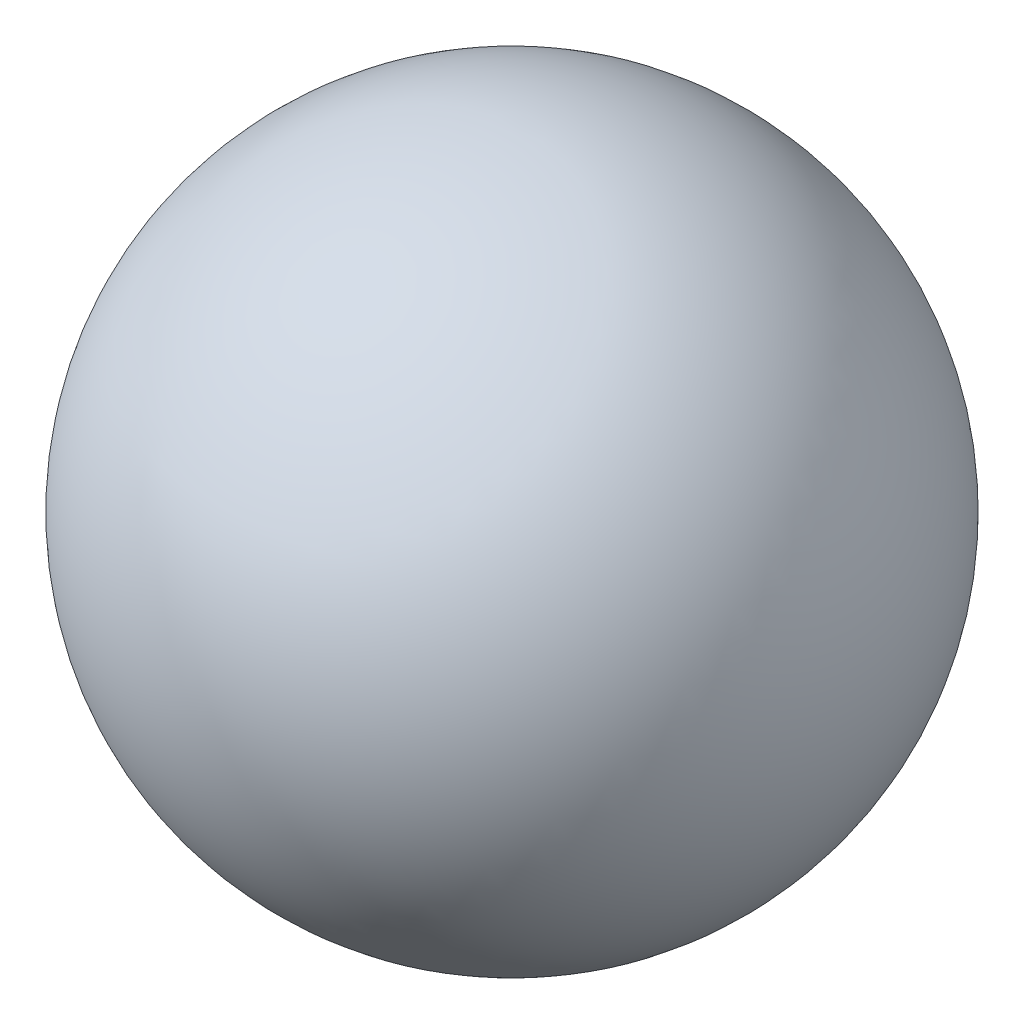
from build123d import *


with BuildPart() as part:
    # Sketch 1 → Revolve 1 (revolve)
    with BuildSketch(Plane.XY):
        with BuildLine():
            Line((0, 0), (0, 100))
            ThreePointArc((0, 100), (50, 50), (0, 0))
        make_face()
    revolve(axis=Axis((0, 0, 0), (0, 1, 0)))


solid = part.part
